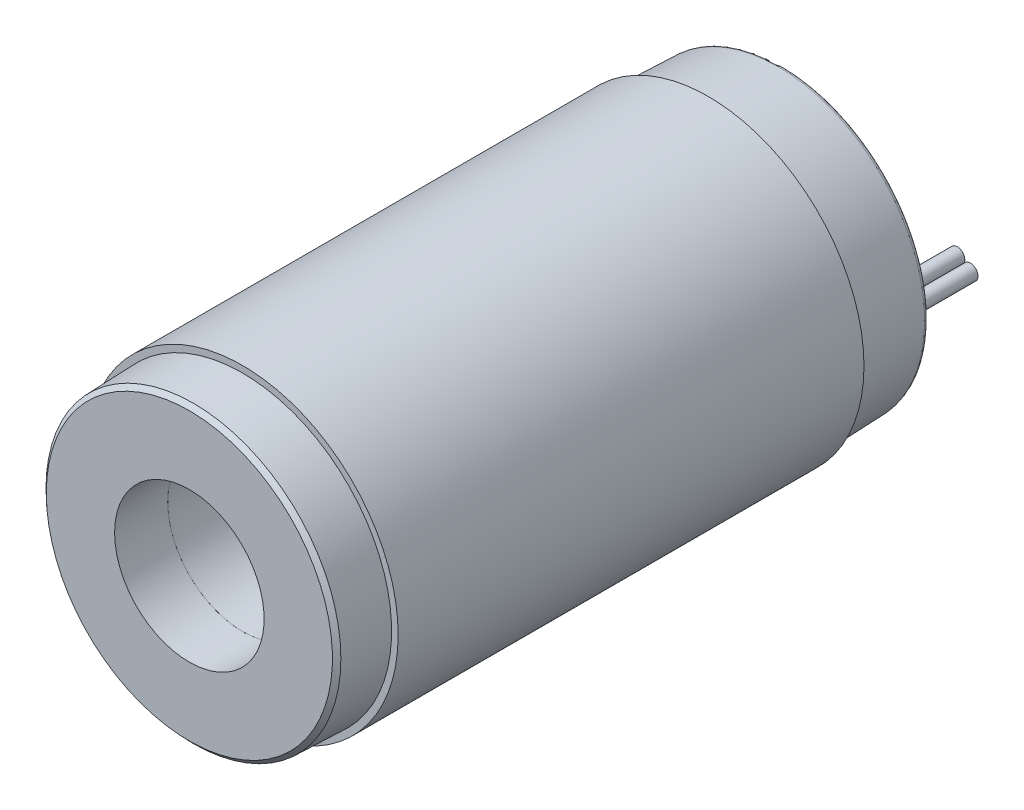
ISO-10303-21;
HEADER;
FILE_DESCRIPTION(('STEP AP214'),'2;1');
FILE_NAME('part.step','',(''),(''),'','','');
FILE_SCHEMA(('AUTOMOTIVE_DESIGN { 1 0 10303 214 1 1 1 1 }'));
ENDSEC;
DATA;
#1=APPLICATION_CONTEXT('core data for automotive mechanical design processes');
#2=APPLICATION_PROTOCOL_DEFINITION('international standard','automotive_design',2000,#1);
#3=PRODUCT_CONTEXT('',#1,'mechanical');
#4=PRODUCT('Part','Part','',(#3));
#5=PRODUCT_RELATED_PRODUCT_CATEGORY('part','',(#4));
#6=PRODUCT_DEFINITION_FORMATION('','',#4);
#7=PRODUCT_DEFINITION_CONTEXT('part definition',#1,'design');
#8=PRODUCT_DEFINITION('design','',#6,#7);
#9=PRODUCT_DEFINITION_SHAPE('','',#8);
#10=(LENGTH_UNIT() NAMED_UNIT(*) SI_UNIT(.MILLI.,.METRE.));
#11=(NAMED_UNIT(*) PLANE_ANGLE_UNIT() SI_UNIT($,.RADIAN.));
#12=(NAMED_UNIT(*) SI_UNIT($,.STERADIAN.) SOLID_ANGLE_UNIT());
#13=UNCERTAINTY_MEASURE_WITH_UNIT(LENGTH_MEASURE(1.E-05),#10,'distance_accuracy_value','');
#14=(GEOMETRIC_REPRESENTATION_CONTEXT(3) GLOBAL_UNCERTAINTY_ASSIGNED_CONTEXT((#13)) GLOBAL_UNIT_ASSIGNED_CONTEXT((#10,
#11,#12)) REPRESENTATION_CONTEXT('',''));
#15=CARTESIAN_POINT('',(0.,0.,0.));
#16=DIRECTION('',(0.,0.,1.));
#17=DIRECTION('',(1.,0.,0.));
#18=AXIS2_PLACEMENT_3D('',#15,#16,#17);
#19=CARTESIAN_POINT('',(0.,0.,-7.67378533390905));
#20=DIRECTION('',(0.,0.,-1.));
#21=DIRECTION('',(-1.,0.,0.));
#22=AXIS2_PLACEMENT_3D('',#19,#20,#21);
#23=CONICAL_SURFACE('',#22,11.1041974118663,0.174672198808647);
#24=CARTESIAN_POINT('',(0.,0.,-7.67378533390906));
#25=DIRECTION('',(0.,0.,-1.));
#26=DIRECTION('',(1.,0.,0.));
#27=AXIS2_PLACEMENT_3D('',#24,#25,#26);
#28=CIRCLE('',#27,11.1041974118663);
#29=CARTESIAN_POINT('',(11.1041974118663,0.,-7.67378533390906));
#30=VERTEX_POINT('',#29);
#31=EDGE_CURVE('P0_E98',#30,#30,#28,.F.);
#32=ORIENTED_EDGE('',*,*,#31,.T.);
#33=EDGE_LOOP('',(#32));
#34=FACE_BOUND('',#33,.T.);
#35=CARTESIAN_POINT('',(0.,0.,2.70287264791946E-10));
#36=DIRECTION('',(0.,0.,-1.));
#37=DIRECTION('',(-1.,0.,0.));
#38=AXIS2_PLACEMENT_3D('',#35,#36,#37);
#39=CIRCLE('',#38,9.75000000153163);
#40=CARTESIAN_POINT('',(-9.75000000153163,0.,2.70287264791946E-10));
#41=VERTEX_POINT('',#40);
#42=EDGE_CURVE('P0_E18',#41,#41,#39,.F.);
#43=ORIENTED_EDGE('',*,*,#42,.F.);
#44=EDGE_LOOP('',(#43));
#45=FACE_BOUND('',#44,.T.);
#46=ADVANCED_FACE('P0_F15',(#34,#45),#23,.T.);
#47=CARTESIAN_POINT('',(0.,0.,-7.5));
#48=DIRECTION('',(0.,0.,-1.));
#49=DIRECTION('',(1.,0.,0.));
#50=AXIS2_PLACEMENT_3D('',#47,#48,#49);
#51=TOROIDAL_SURFACE('',#50,12.0889809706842,0.999999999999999);
#52=CARTESIAN_POINT('',(0.,0.,-8.5));
#53=DIRECTION('',(0.,0.,1.));
#54=DIRECTION('',(-1.,0.,0.));
#55=AXIS2_PLACEMENT_3D('',#52,#53,#54);
#56=CIRCLE('',#55,12.0889809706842);
#57=CARTESIAN_POINT('',(-12.0889809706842,0.,-8.5));
#58=VERTEX_POINT('',#57);
#59=EDGE_CURVE('P0_E123',#58,#58,#56,.F.);
#60=ORIENTED_EDGE('',*,*,#59,.F.);
#61=EDGE_LOOP('',(#60));
#62=FACE_BOUND('',#61,.T.);
#63=ORIENTED_EDGE('',*,*,#31,.F.);
#64=EDGE_LOOP('',(#63));
#65=FACE_BOUND('',#64,.T.);
#66=ADVANCED_FACE('P0_F100',(#62,#65),#51,.F.);
#67=CARTESIAN_POINT('',(9.75,0.,0.));
#68=DIRECTION('',(0.,0.,1.));
#69=DIRECTION('',(1.,0.,0.));
#70=AXIS2_PLACEMENT_3D('',#67,#68,#69);
#71=PLANE('',#70);
#72=ORIENTED_EDGE('',*,*,#42,.T.);
#73=EDGE_LOOP('',(#72));
#74=FACE_BOUND('',#73,.T.);
#75=CARTESIAN_POINT('',(0.,0.,0.));
#76=DIRECTION('',(0.,0.,-1.));
#77=DIRECTION('',(-1.,0.,0.));
#78=AXIS2_PLACEMENT_3D('',#75,#76,#77);
#79=CIRCLE('',#78,9.15);
#80=CARTESIAN_POINT('',(-9.15,0.,0.));
#81=VERTEX_POINT('',#80);
#82=EDGE_CURVE('P0_E121',#81,#81,#79,.T.);
#83=ORIENTED_EDGE('',*,*,#82,.T.);
#84=EDGE_LOOP('',(#83));
#85=FACE_BOUND('',#84,.T.);
#86=ADVANCED_FACE('P0_F104',(#74,#85),#71,.T.);
#87=CARTESIAN_POINT('',(16.65,0.,-8.5));
#88=DIRECTION('',(0.,0.,1.));
#89=DIRECTION('',(1.,0.,0.));
#90=AXIS2_PLACEMENT_3D('',#87,#88,#89);
#91=PLANE('',#90);
#92=CARTESIAN_POINT('',(0.,0.,-8.5));
#93=DIRECTION('',(0.,0.,-1.));
#94=DIRECTION('',(-1.,0.,0.));
#95=AXIS2_PLACEMENT_3D('',#92,#93,#94);
#96=CIRCLE('',#95,16.65);
#97=CARTESIAN_POINT('',(-16.65,0.,-8.5));
#98=VERTEX_POINT('',#97);
#99=EDGE_CURVE('P0_E66',#98,#98,#96,.F.);
#100=ORIENTED_EDGE('',*,*,#99,.T.);
#101=EDGE_LOOP('',(#100));
#102=FACE_BOUND('',#101,.T.);
#103=ORIENTED_EDGE('',*,*,#59,.T.);
#104=EDGE_LOOP('',(#103));
#105=FACE_BOUND('',#104,.T.);
#106=ADVANCED_FACE('P0_F158',(#102,#105),#91,.T.);
#107=CARTESIAN_POINT('',(0.,0.,0.));
#108=DIRECTION('',(0.,0.,-1.));
#109=DIRECTION('',(-1.,0.,0.));
#110=AXIS2_PLACEMENT_3D('',#107,#108,#109);
#111=CYLINDRICAL_SURFACE('',#110,9.15);
#112=ORIENTED_EDGE('',*,*,#82,.F.);
#113=EDGE_LOOP('',(#112));
#114=FACE_BOUND('',#113,.T.);
#115=CARTESIAN_POINT('',(0.,0.,-8.));
#116=DIRECTION('',(0.,0.,-1.));
#117=DIRECTION('',(1.,0.,0.));
#118=AXIS2_PLACEMENT_3D('',#115,#116,#117);
#119=CIRCLE('',#118,9.15);
#120=CARTESIAN_POINT('',(9.15,0.,-8.));
#121=VERTEX_POINT('',#120);
#122=EDGE_CURVE('P0_E61',#121,#121,#119,.T.);
#123=ORIENTED_EDGE('',*,*,#122,.T.);
#124=EDGE_LOOP('',(#123));
#125=FACE_BOUND('',#124,.T.);
#126=ADVANCED_FACE('P0_F80',(#114,#125),#111,.F.);
#127=CARTESIAN_POINT('',(0.,0.,-7.5));
#128=DIRECTION('',(0.,0.,-1.));
#129=DIRECTION('',(1.,0.,0.));
#130=AXIS2_PLACEMENT_3D('',#127,#128,#129);
#131=TOROIDAL_SURFACE('',#130,16.65,1.);
#132=CARTESIAN_POINT('',(0.,0.,-7.5));
#133=DIRECTION('',(0.,0.,-1.));
#134=DIRECTION('',(-1.,0.,0.));
#135=AXIS2_PLACEMENT_3D('',#132,#133,#134);
#136=CIRCLE('',#135,17.65);
#137=CARTESIAN_POINT('',(-17.65,0.,-7.5));
#138=VERTEX_POINT('',#137);
#139=EDGE_CURVE('P0_E52',#138,#138,#136,.F.);
#140=ORIENTED_EDGE('',*,*,#139,.T.);
#141=EDGE_LOOP('',(#140));
#142=FACE_BOUND('',#141,.T.);
#143=ORIENTED_EDGE('',*,*,#99,.F.);
#144=EDGE_LOOP('',(#143));
#145=FACE_BOUND('',#144,.T.);
#146=ADVANCED_FACE('P0_F74',(#142,#145),#131,.F.);
#147=CARTESIAN_POINT('',(0.,0.,-9.00000000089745));
#148=DIRECTION('',(0.,0.,-1.));
#149=DIRECTION('',(-1.,0.,0.));
#150=AXIS2_PLACEMENT_3D('',#147,#148,#149);
#151=CONICAL_SURFACE('',#150,10.1499999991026,0.785398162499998);
#152=ORIENTED_EDGE('',*,*,#122,.F.);
#153=EDGE_LOOP('',(#152));
#154=FACE_BOUND('',#153,.T.);
#155=CARTESIAN_POINT('',(0.,0.,-9.00000000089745));
#156=DIRECTION('',(0.,0.,-1.));
#157=DIRECTION('',(-1.,0.,0.));
#158=AXIS2_PLACEMENT_3D('',#155,#156,#157);
#159=CIRCLE('',#158,10.1499999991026);
#160=CARTESIAN_POINT('',(-10.1499999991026,0.,-9.00000000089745));
#161=VERTEX_POINT('',#160);
#162=EDGE_CURVE('P0_E60',#161,#161,#159,.F.);
#163=ORIENTED_EDGE('',*,*,#162,.F.);
#164=EDGE_LOOP('',(#163));
#165=FACE_BOUND('',#164,.T.);
#166=ADVANCED_FACE('P0_F79',(#154,#165),#151,.F.);
#167=CARTESIAN_POINT('',(0.,0.,0.));
#168=DIRECTION('',(0.,0.,-1.));
#169=DIRECTION('',(-1.,0.,0.));
#170=AXIS2_PLACEMENT_3D('',#167,#168,#169);
#171=CYLINDRICAL_SURFACE('',#170,17.65);
#172=CARTESIAN_POINT('',(0.,0.,0.));
#173=DIRECTION('',(0.,0.,-1.));
#174=DIRECTION('',(-1.,0.,0.));
#175=AXIS2_PLACEMENT_3D('',#172,#173,#174);
#176=CIRCLE('',#175,17.65);
#177=CARTESIAN_POINT('',(-17.65,0.,0.));
#178=VERTEX_POINT('',#177);
#179=EDGE_CURVE('P0_E117',#178,#178,#176,.T.);
#180=ORIENTED_EDGE('',*,*,#179,.F.);
#181=EDGE_LOOP('',(#180));
#182=FACE_BOUND('',#181,.T.);
#183=ORIENTED_EDGE('',*,*,#139,.F.);
#184=EDGE_LOOP('',(#183));
#185=FACE_BOUND('',#184,.T.);
#186=ADVANCED_FACE('P0_F151',(#182,#185),#171,.F.);
#187=CARTESIAN_POINT('',(10.15,0.,-9.));
#188=DIRECTION('',(0.,0.,-1.));
#189=DIRECTION('',(-1.,0.,0.));
#190=AXIS2_PLACEMENT_3D('',#187,#188,#189);
#191=PLANE('',#190);
#192=ORIENTED_EDGE('',*,*,#162,.T.);
#193=EDGE_LOOP('',(#192));
#194=FACE_BOUND('',#193,.T.);
#195=CARTESIAN_POINT('',(0.,0.,-9.));
#196=DIRECTION('',(0.,0.,1.));
#197=DIRECTION('',(-1.,0.,0.));
#198=AXIS2_PLACEMENT_3D('',#195,#196,#197);
#199=CIRCLE('',#198,17.4528686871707);
#200=CARTESIAN_POINT('',(-17.4528686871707,0.,-9.));
#201=VERTEX_POINT('',#200);
#202=EDGE_CURVE('P0_E27',#201,#201,#199,.T.);
#203=ORIENTED_EDGE('',*,*,#202,.F.);
#204=EDGE_LOOP('',(#203));
#205=FACE_BOUND('',#204,.T.);
#206=ADVANCED_FACE('P0_F148',(#194,#205),#191,.T.);
#207=CARTESIAN_POINT('',(18.25,0.,0.));
#208=DIRECTION('',(0.,0.,1.));
#209=DIRECTION('',(1.,0.,0.));
#210=AXIS2_PLACEMENT_3D('',#207,#208,#209);
#211=PLANE('',#210);
#212=CARTESIAN_POINT('',(0.,0.,1.18290793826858E-11));
#213=DIRECTION('',(0.,0.,1.));
#214=DIRECTION('',(1.,0.,0.));
#215=AXIS2_PLACEMENT_3D('',#212,#213,#214);
#216=CIRCLE('',#215,18.2499999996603);
#217=CARTESIAN_POINT('',(18.2499999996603,0.,1.18290793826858E-11));
#218=VERTEX_POINT('',#217);
#219=EDGE_CURVE('P0_E22',#218,#218,#216,.F.);
#220=ORIENTED_EDGE('',*,*,#219,.F.);
#221=EDGE_LOOP('',(#220));
#222=FACE_BOUND('',#221,.T.);
#223=ORIENTED_EDGE('',*,*,#179,.T.);
#224=EDGE_LOOP('',(#223));
#225=FACE_BOUND('',#224,.T.);
#226=ADVANCED_FACE('P0_F43',(#222,#225),#211,.T.);
#227=CARTESIAN_POINT('',(0.,0.,-8.5));
#228=DIRECTION('',(0.,0.,-1.));
#229=DIRECTION('',(1.,0.,0.));
#230=AXIS2_PLACEMENT_3D('',#227,#228,#229);
#231=TOROIDAL_SURFACE('',#230,17.4528686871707,0.499999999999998);
#232=ORIENTED_EDGE('',*,*,#202,.T.);
#233=EDGE_LOOP('',(#232));
#234=FACE_BOUND('',#233,.T.);
#235=CARTESIAN_POINT('',(0.,0.,-8.51744974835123));
#236=DIRECTION('',(0.,0.,1.));
#237=DIRECTION('',(-1.,0.,0.));
#238=AXIS2_PLACEMENT_3D('',#235,#236,#237);
#239=CIRCLE('',#238,17.9525641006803);
#240=CARTESIAN_POINT('',(-17.9525641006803,0.,-8.51744974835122));
#241=VERTEX_POINT('',#240);
#242=EDGE_CURVE('P0_E10',#241,#241,#239,.T.);
#243=ORIENTED_EDGE('',*,*,#242,.F.);
#244=EDGE_LOOP('',(#243));
#245=FACE_BOUND('',#244,.T.);
#246=ADVANCED_FACE('P0_F37',(#234,#245),#231,.T.);
#247=CARTESIAN_POINT('',(0.,0.,1.18238752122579E-11));
#248=DIRECTION('',(0.,0.,1.));
#249=DIRECTION('',(1.,0.,0.));
#250=AXIS2_PLACEMENT_3D('',#247,#248,#249);
#251=CONICAL_SURFACE('',#250,18.2499999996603,0.0349065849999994);
#252=ORIENTED_EDGE('',*,*,#242,.T.);
#253=EDGE_LOOP('',(#252));
#254=FACE_BOUND('',#253,.T.);
#255=ORIENTED_EDGE('',*,*,#219,.T.);
#256=EDGE_LOOP('',(#255));
#257=FACE_BOUND('',#256,.T.);
#258=ADVANCED_FACE('P0_F42',(#254,#257),#251,.T.);
#259=CLOSED_SHELL('',(#46,#66,#86,#106,#126,#146,#166,#186,#206,#226,#246,#258));
#260=MANIFOLD_SOLID_BREP('P0_B1',#259);
#261=CARTESIAN_POINT('',(0.,0.,61.7));
#262=DIRECTION('',(0.,0.,-1.));
#263=DIRECTION('',(1.,0.,0.));
#264=AXIS2_PLACEMENT_3D('',#261,#262,#263);
#265=TOROIDAL_SURFACE('',#264,16.65,1.);
#266=CARTESIAN_POINT('',(0.,0.,61.7));
#267=DIRECTION('',(0.,0.,-1.));
#268=DIRECTION('',(-1.,0.,0.));
#269=AXIS2_PLACEMENT_3D('',#266,#267,#268);
#270=CIRCLE('',#269,17.65);
#271=CARTESIAN_POINT('',(-17.65,0.,61.7));
#272=VERTEX_POINT('',#271);
#273=EDGE_CURVE('P1_E67',#272,#272,#270,.T.);
#274=ORIENTED_EDGE('',*,*,#273,.T.);
#275=EDGE_LOOP('',(#274));
#276=FACE_BOUND('',#275,.T.);
#277=CARTESIAN_POINT('',(0.,0.,62.7));
#278=DIRECTION('',(0.,0.,1.));
#279=DIRECTION('',(-1.,0.,0.));
#280=AXIS2_PLACEMENT_3D('',#277,#278,#279);
#281=CIRCLE('',#280,16.65);
#282=CARTESIAN_POINT('',(-16.65,0.,62.7));
#283=VERTEX_POINT('',#282);
#284=EDGE_CURVE('P1_E94',#283,#283,#281,.T.);
#285=ORIENTED_EDGE('',*,*,#284,.T.);
#286=EDGE_LOOP('',(#285));
#287=FACE_BOUND('',#286,.T.);
#288=ADVANCED_FACE('P1_F15',(#276,#287),#265,.F.);
#289=CARTESIAN_POINT('',(16.65,0.,62.7));
#290=DIRECTION('',(0.,0.,1.));
#291=DIRECTION('',(1.,0.,0.));
#292=AXIS2_PLACEMENT_3D('',#289,#290,#291);
#293=PLANE('',#292);
#294=ORIENTED_EDGE('',*,*,#284,.F.);
#295=EDGE_LOOP('',(#294));
#296=FACE_BOUND('',#295,.T.);
#297=CARTESIAN_POINT('',(0.,0.,62.7));
#298=DIRECTION('',(0.,0.,-1.));
#299=DIRECTION('',(-1.,0.,0.));
#300=AXIS2_PLACEMENT_3D('',#297,#298,#299);
#301=CIRCLE('',#300,12.);
#302=CARTESIAN_POINT('',(-12.,0.,62.7));
#303=VERTEX_POINT('',#302);
#304=EDGE_CURVE('P1_E58',#303,#303,#301,.F.);
#305=ORIENTED_EDGE('',*,*,#304,.T.);
#306=EDGE_LOOP('',(#305));
#307=FACE_BOUND('',#306,.T.);
#308=ADVANCED_FACE('P1_F107',(#296,#307),#293,.F.);
#309=CARTESIAN_POINT('',(0.,0.,0.));
#310=DIRECTION('',(0.,0.,-1.));
#311=DIRECTION('',(-1.,0.,0.));
#312=AXIS2_PLACEMENT_3D('',#309,#310,#311);
#313=CYLINDRICAL_SURFACE('',#312,17.65);
#314=CARTESIAN_POINT('',(0.,0.,57.));
#315=DIRECTION('',(0.,0.,-1.));
#316=DIRECTION('',(-1.,0.,0.));
#317=AXIS2_PLACEMENT_3D('',#314,#315,#316);
#318=CIRCLE('',#317,17.65);
#319=CARTESIAN_POINT('',(-17.65,0.,57.));
#320=VERTEX_POINT('',#319);
#321=EDGE_CURVE('P1_E20',#320,#320,#318,.T.);
#322=ORIENTED_EDGE('',*,*,#321,.T.);
#323=EDGE_LOOP('',(#322));
#324=FACE_BOUND('',#323,.T.);
#325=ORIENTED_EDGE('',*,*,#273,.F.);
#326=EDGE_LOOP('',(#325));
#327=FACE_BOUND('',#326,.T.);
#328=ADVANCED_FACE('P1_F76',(#324,#327),#313,.F.);
#329=CARTESIAN_POINT('',(0.,0.,61.7));
#330=DIRECTION('',(0.,0.,-1.));
#331=DIRECTION('',(1.,0.,0.));
#332=AXIS2_PLACEMENT_3D('',#329,#330,#331);
#333=TOROIDAL_SURFACE('',#332,12.,1.);
#334=ORIENTED_EDGE('',*,*,#304,.F.);
#335=EDGE_LOOP('',(#334));
#336=FACE_BOUND('',#335,.T.);
#337=CARTESIAN_POINT('',(0.,0.,61.7));
#338=DIRECTION('',(0.,0.,-1.));
#339=DIRECTION('',(-1.,0.,0.));
#340=AXIS2_PLACEMENT_3D('',#337,#338,#339);
#341=CIRCLE('',#340,11.);
#342=CARTESIAN_POINT('',(-11.,0.,61.7));
#343=VERTEX_POINT('',#342);
#344=EDGE_CURVE('P1_E47',#343,#343,#341,.T.);
#345=ORIENTED_EDGE('',*,*,#344,.F.);
#346=EDGE_LOOP('',(#345));
#347=FACE_BOUND('',#346,.T.);
#348=ADVANCED_FACE('P1_F70',(#336,#347),#333,.F.);
#349=CARTESIAN_POINT('',(18.25,0.,57.));
#350=DIRECTION('',(0.,0.,1.));
#351=DIRECTION('',(1.,0.,0.));
#352=AXIS2_PLACEMENT_3D('',#349,#350,#351);
#353=PLANE('',#352);
#354=CARTESIAN_POINT('',(0.,0.,56.999999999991));
#355=DIRECTION('',(0.,0.,-1.));
#356=DIRECTION('',(-1.,0.,0.));
#357=AXIS2_PLACEMENT_3D('',#354,#355,#356);
#358=CIRCLE('',#357,18.2499999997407);
#359=CARTESIAN_POINT('',(-18.2499999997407,0.,56.999999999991));
#360=VERTEX_POINT('',#359);
#361=EDGE_CURVE('P1_E44',#360,#360,#358,.F.);
#362=ORIENTED_EDGE('',*,*,#361,.F.);
#363=EDGE_LOOP('',(#362));
#364=FACE_BOUND('',#363,.T.);
#365=ORIENTED_EDGE('',*,*,#321,.F.);
#366=EDGE_LOOP('',(#365));
#367=FACE_BOUND('',#366,.T.);
#368=ADVANCED_FACE('P1_F75',(#364,#367),#353,.F.);
#369=CARTESIAN_POINT('',(0.,0.,0.));
#370=DIRECTION('',(0.,0.,-1.));
#371=DIRECTION('',(-1.,0.,0.));
#372=AXIS2_PLACEMENT_3D('',#369,#370,#371);
#373=CYLINDRICAL_SURFACE('',#372,11.);
#374=ORIENTED_EDGE('',*,*,#344,.T.);
#375=EDGE_LOOP('',(#374));
#376=FACE_BOUND('',#375,.T.);
#377=CARTESIAN_POINT('',(0.,0.,57.));
#378=DIRECTION('',(0.,0.,-1.));
#379=DIRECTION('',(-1.,0.,0.));
#380=AXIS2_PLACEMENT_3D('',#377,#378,#379);
#381=CIRCLE('',#380,11.);
#382=CARTESIAN_POINT('',(-11.,0.,57.));
#383=VERTEX_POINT('',#382);
#384=EDGE_CURVE('P1_E41',#383,#383,#381,.F.);
#385=ORIENTED_EDGE('',*,*,#384,.T.);
#386=EDGE_LOOP('',(#385));
#387=FACE_BOUND('',#386,.T.);
#388=ADVANCED_FACE('P1_F157',(#376,#387),#373,.T.);
#389=CARTESIAN_POINT('',(0.,0.,56.999999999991));
#390=DIRECTION('',(0.,0.,-1.));
#391=DIRECTION('',(-1.,0.,0.));
#392=AXIS2_PLACEMENT_3D('',#389,#390,#391);
#393=CONICAL_SURFACE('',#392,18.2499999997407,0.0349065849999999);
#394=ORIENTED_EDGE('',*,*,#361,.T.);
#395=EDGE_LOOP('',(#394));
#396=FACE_BOUND('',#395,.T.);
#397=CARTESIAN_POINT('',(0.,0.,63.0003045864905));
#398=DIRECTION('',(0.,0.,-1.));
#399=DIRECTION('',(1.,0.,0.));
#400=AXIS2_PLACEMENT_3D('',#397,#398,#399);
#401=CIRCLE('',#400,18.0404647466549);
#402=CARTESIAN_POINT('',(18.0404647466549,0.,63.0003045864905));
#403=VERTEX_POINT('',#402);
#404=EDGE_CURVE('P1_E40',#403,#403,#401,.F.);
#405=ORIENTED_EDGE('',*,*,#404,.F.);
#406=EDGE_LOOP('',(#405));
#407=FACE_BOUND('',#406,.T.);
#408=ADVANCED_FACE('P1_F154',(#396,#407),#393,.T.);
#409=CARTESIAN_POINT('',(11.,0.,57.));
#410=DIRECTION('',(0.,0.,1.));
#411=DIRECTION('',(1.,0.,0.));
#412=AXIS2_PLACEMENT_3D('',#409,#410,#411);
#413=PLANE('',#412);
#414=ORIENTED_EDGE('',*,*,#384,.F.);
#415=EDGE_LOOP('',(#414));
#416=FACE_BOUND('',#415,.T.);
#417=CARTESIAN_POINT('',(0.,0.,57.));
#418=DIRECTION('',(0.,0.,-1.));
#419=DIRECTION('',(-1.,0.,0.));
#420=AXIS2_PLACEMENT_3D('',#417,#418,#419);
#421=CIRCLE('',#420,9.14999999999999);
#422=CARTESIAN_POINT('',(-9.14999999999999,0.,57.));
#423=VERTEX_POINT('',#422);
#424=EDGE_CURVE('P1_E30',#423,#423,#421,.F.);
#425=ORIENTED_EDGE('',*,*,#424,.T.);
#426=EDGE_LOOP('',(#425));
#427=FACE_BOUND('',#426,.T.);
#428=ADVANCED_FACE('P1_F150',(#416,#427),#413,.F.);
#429=CARTESIAN_POINT('',(0.,0.,63.0003045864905));
#430=DIRECTION('',(0.,0.,-1.));
#431=DIRECTION('',(-1.,0.,0.));
#432=AXIS2_PLACEMENT_3D('',#429,#430,#431);
#433=CONICAL_SURFACE('',#432,18.0404647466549,0.820304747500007);
#434=ORIENTED_EDGE('',*,*,#404,.T.);
#435=EDGE_LOOP('',(#434));
#436=FACE_BOUND('',#435,.T.);
#437=CARTESIAN_POINT('',(0.,0.,63.5000000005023));
#438=DIRECTION('',(0.,0.,-1.));
#439=DIRECTION('',(-1.,0.,0.));
#440=AXIS2_PLACEMENT_3D('',#437,#438,#439);
#441=CIRCLE('',#440,17.5046070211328);
#442=CARTESIAN_POINT('',(-17.5046070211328,0.,63.5000000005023));
#443=VERTEX_POINT('',#442);
#444=EDGE_CURVE('P1_E24',#443,#443,#441,.T.);
#445=ORIENTED_EDGE('',*,*,#444,.T.);
#446=EDGE_LOOP('',(#445));
#447=FACE_BOUND('',#446,.T.);
#448=ADVANCED_FACE('P1_F143',(#436,#447),#433,.T.);
#449=CARTESIAN_POINT('',(0.,0.,0.));
#450=DIRECTION('',(0.,0.,-1.));
#451=DIRECTION('',(-1.,0.,0.));
#452=AXIS2_PLACEMENT_3D('',#449,#450,#451);
#453=CYLINDRICAL_SURFACE('',#452,9.14999999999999);
#454=ORIENTED_EDGE('',*,*,#424,.F.);
#455=EDGE_LOOP('',(#454));
#456=FACE_BOUND('',#455,.T.);
#457=CARTESIAN_POINT('',(0.,0.,63.5));
#458=DIRECTION('',(0.,0.,-1.));
#459=DIRECTION('',(-1.,0.,0.));
#460=AXIS2_PLACEMENT_3D('',#457,#458,#459);
#461=CIRCLE('',#460,9.14999999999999);
#462=CARTESIAN_POINT('',(-9.14999999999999,0.,63.5));
#463=VERTEX_POINT('',#462);
#464=EDGE_CURVE('P1_E10',#463,#463,#461,.F.);
#465=ORIENTED_EDGE('',*,*,#464,.T.);
#466=EDGE_LOOP('',(#465));
#467=FACE_BOUND('',#466,.T.);
#468=ADVANCED_FACE('P1_F136',(#456,#467),#453,.F.);
#469=CARTESIAN_POINT('',(9.14999999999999,0.,63.5));
#470=DIRECTION('',(0.,0.,-1.));
#471=DIRECTION('',(-1.,0.,0.));
#472=AXIS2_PLACEMENT_3D('',#469,#470,#471);
#473=PLANE('',#472);
#474=ORIENTED_EDGE('',*,*,#464,.F.);
#475=EDGE_LOOP('',(#474));
#476=FACE_BOUND('',#475,.T.);
#477=ORIENTED_EDGE('',*,*,#444,.F.);
#478=EDGE_LOOP('',(#477));
#479=FACE_BOUND('',#478,.T.);
#480=ADVANCED_FACE('P1_F134',(#476,#479),#473,.F.);
#481=CLOSED_SHELL('',(#288,#308,#328,#348,#368,#388,#408,#428,#448,#468,#480));
#482=MANIFOLD_SOLID_BREP('P1_B1',#481);
#483=CARTESIAN_POINT('',(0.,0.,0.));
#484=DIRECTION('',(0.,0.,1.));
#485=DIRECTION('',(1.,0.,0.));
#486=AXIS2_PLACEMENT_3D('',#483,#484,#485);
#487=CYLINDRICAL_SURFACE('',#486,9.15);
#488=CARTESIAN_POINT('',(0.,0.,0.));
#489=DIRECTION('',(0.,0.,1.));
#490=DIRECTION('',(1.,0.,0.));
#491=AXIS2_PLACEMENT_3D('',#488,#489,#490);
#492=CIRCLE('',#491,9.15);
#493=CARTESIAN_POINT('',(9.15,0.,0.));
#494=VERTEX_POINT('',#493);
#495=EDGE_CURVE('P2_E28',#494,#494,#492,.T.);
#496=ORIENTED_EDGE('',*,*,#495,.F.);
#497=EDGE_LOOP('',(#496));
#498=FACE_BOUND('',#497,.T.);
#499=CARTESIAN_POINT('',(0.,0.,57.));
#500=DIRECTION('',(0.,0.,1.));
#501=DIRECTION('',(1.,0.,0.));
#502=AXIS2_PLACEMENT_3D('',#499,#500,#501);
#503=CIRCLE('',#502,9.15);
#504=CARTESIAN_POINT('',(9.15,0.,57.));
#505=VERTEX_POINT('',#504);
#506=EDGE_CURVE('P2_E18',#505,#505,#503,.F.);
#507=ORIENTED_EDGE('',*,*,#506,.F.);
#508=EDGE_LOOP('',(#507));
#509=FACE_BOUND('',#508,.T.);
#510=ADVANCED_FACE('P2_F15',(#498,#509),#487,.F.);
#511=CARTESIAN_POINT('',(0.,0.,57.));
#512=DIRECTION('',(0.,0.,1.));
#513=DIRECTION('',(1.,0.,0.));
#514=AXIS2_PLACEMENT_3D('',#511,#512,#513);
#515=PLANE('',#514);
#516=CARTESIAN_POINT('',(0.,0.,57.));
#517=DIRECTION('',(0.,0.,1.));
#518=DIRECTION('',(1.,0.,0.));
#519=AXIS2_PLACEMENT_3D('',#516,#517,#518);
#520=CIRCLE('',#519,19.05);
#521=CARTESIAN_POINT('',(19.05,0.,57.));
#522=VERTEX_POINT('',#521);
#523=EDGE_CURVE('P2_E22',#522,#522,#520,.F.);
#524=ORIENTED_EDGE('',*,*,#523,.F.);
#525=EDGE_LOOP('',(#524));
#526=FACE_BOUND('',#525,.T.);
#527=ORIENTED_EDGE('',*,*,#506,.T.);
#528=EDGE_LOOP('',(#527));
#529=FACE_BOUND('',#528,.T.);
#530=ADVANCED_FACE('P2_F38',(#526,#529),#515,.T.);
#531=CARTESIAN_POINT('',(0.,0.,0.));
#532=DIRECTION('',(0.,0.,-1.));
#533=DIRECTION('',(-1.,0.,0.));
#534=AXIS2_PLACEMENT_3D('',#531,#532,#533);
#535=PLANE('',#534);
#536=CARTESIAN_POINT('',(0.,0.,0.));
#537=DIRECTION('',(0.,0.,1.));
#538=DIRECTION('',(1.,0.,0.));
#539=AXIS2_PLACEMENT_3D('',#536,#537,#538);
#540=CIRCLE('',#539,19.05);
#541=CARTESIAN_POINT('',(19.05,0.,0.));
#542=VERTEX_POINT('',#541);
#543=EDGE_CURVE('P2_E10',#542,#542,#540,.T.);
#544=ORIENTED_EDGE('',*,*,#543,.F.);
#545=EDGE_LOOP('',(#544));
#546=FACE_BOUND('',#545,.T.);
#547=ORIENTED_EDGE('',*,*,#495,.T.);
#548=EDGE_LOOP('',(#547));
#549=FACE_BOUND('',#548,.T.);
#550=ADVANCED_FACE('P2_F46',(#546,#549),#535,.T.);
#551=CARTESIAN_POINT('',(0.,0.,0.));
#552=DIRECTION('',(0.,0.,1.));
#553=DIRECTION('',(1.,0.,0.));
#554=AXIS2_PLACEMENT_3D('',#551,#552,#553);
#555=CYLINDRICAL_SURFACE('',#554,19.05);
#556=ORIENTED_EDGE('',*,*,#543,.T.);
#557=EDGE_LOOP('',(#556));
#558=FACE_BOUND('',#557,.T.);
#559=ORIENTED_EDGE('',*,*,#523,.T.);
#560=EDGE_LOOP('',(#559));
#561=FACE_BOUND('',#560,.T.);
#562=ADVANCED_FACE('P2_F48',(#558,#561),#555,.T.);
#563=CLOSED_SHELL('',(#510,#530,#550,#562));
#564=MANIFOLD_SOLID_BREP('P2_B1',#563);
#565=CARTESIAN_POINT('',(13.9641016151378,0.,-8.5));
#566=DIRECTION('',(0.,0.,-1.));
#567=DIRECTION('',(-1.,0.,0.));
#568=AXIS2_PLACEMENT_3D('',#565,#566,#567);
#569=PLANE('',#568);
#570=CARTESIAN_POINT('',(15.5717967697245,0.,-8.5));
#571=DIRECTION('',(0.,0.,1.));
#572=DIRECTION('',(1.,0.,0.));
#573=AXIS2_PLACEMENT_3D('',#570,#571,#572);
#574=CIRCLE('',#573,0.928203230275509);
#575=CARTESIAN_POINT('',(14.7679491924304,0.46410161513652,-8.5));
#576=VERTEX_POINT('',#575);
#577=CARTESIAN_POINT('',(14.7679491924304,-0.464101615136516,-8.5));
#578=VERTEX_POINT('',#577);
#579=EDGE_CURVE('P3_E50',#576,#578,#574,.F.);
#580=ORIENTED_EDGE('',*,*,#579,.F.);
#581=CARTESIAN_POINT('',(13.9641016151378,0.928203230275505,-8.5));
#582=DIRECTION('',(0.,0.,1.));
#583=DIRECTION('',(1.,0.,0.));
#584=AXIS2_PLACEMENT_3D('',#581,#582,#583);
#585=CIRCLE('',#584,0.928203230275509);
#586=CARTESIAN_POINT('',(13.9641016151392,0.,-8.5));
#587=VERTEX_POINT('',#586);
#588=EDGE_CURVE('P3_E52',#587,#576,#585,.F.);
#589=ORIENTED_EDGE('',*,*,#588,.F.);
#590=CARTESIAN_POINT('',(13.9641016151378,-0.928203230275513,-8.5));
#591=DIRECTION('',(0.,0.,1.));
#592=DIRECTION('',(1.,0.,0.));
#593=AXIS2_PLACEMENT_3D('',#590,#591,#592);
#594=CIRCLE('',#593,0.928203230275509);
#595=EDGE_CURVE('P3_E19',#578,#587,#594,.F.);
#596=ORIENTED_EDGE('',*,*,#595,.F.);
#597=EDGE_LOOP('',(#580,#589,#596));
#598=FACE_BOUND('',#597,.T.);
#599=ADVANCED_FACE('P3_F16',(#598),#569,.F.);
#600=CARTESIAN_POINT('',(13.9641016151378,-0.928203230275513,-16.5));
#601=DIRECTION('',(0.,0.,1.));
#602=DIRECTION('',(1.,0.,0.));
#603=AXIS2_PLACEMENT_3D('',#600,#601,#602);
#604=CYLINDRICAL_SURFACE('',#603,0.928203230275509);
#605=CARTESIAN_POINT('',(13.9641016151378,-0.928203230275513,-16.5));
#606=DIRECTION('',(0.,0.,1.));
#607=DIRECTION('',(1.,0.,0.));
#608=AXIS2_PLACEMENT_3D('',#605,#606,#607);
#609=CIRCLE('',#608,0.928203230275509);
#610=CARTESIAN_POINT('',(14.7679491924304,-0.464101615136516,-16.5));
#611=VERTEX_POINT('',#610);
#612=CARTESIAN_POINT('',(13.9641016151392,0.,-16.5));
#613=VERTEX_POINT('',#612);
#614=EDGE_CURVE('P3_E56',#611,#613,#609,.F.);
#615=ORIENTED_EDGE('',*,*,#614,.F.);
#616=DIRECTION('',(0.,0.,1.));
#617=VECTOR('',#616,1.);
#618=CARTESIAN_POINT('',(14.7679491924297,-0.464101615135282,-16.5));
#619=LINE('',#618,#617);
#620=EDGE_CURVE('P3_E58',#578,#611,#619,.F.);
#621=ORIENTED_EDGE('',*,*,#620,.F.);
#622=ORIENTED_EDGE('',*,*,#595,.T.);
#623=DIRECTION('',(0.,0.,1.));
#624=VECTOR('',#623,1.);
#625=CARTESIAN_POINT('',(13.9641016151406,0.,-16.5));
#626=LINE('',#625,#624);
#627=EDGE_CURVE('P3_E64',#613,#587,#626,.T.);
#628=ORIENTED_EDGE('',*,*,#627,.F.);
#629=EDGE_LOOP('',(#615,#621,#622,#628));
#630=FACE_BOUND('',#629,.T.);
#631=ADVANCED_FACE('P3_F59',(#630),#604,.T.);
#632=CARTESIAN_POINT('',(13.9641016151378,0.,-16.5));
#633=DIRECTION('',(0.,0.,-1.));
#634=DIRECTION('',(-1.,0.,0.));
#635=AXIS2_PLACEMENT_3D('',#632,#633,#634);
#636=PLANE('',#635);
#637=CARTESIAN_POINT('',(13.9641016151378,0.928203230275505,-16.5));
#638=DIRECTION('',(0.,0.,1.));
#639=DIRECTION('',(1.,0.,0.));
#640=AXIS2_PLACEMENT_3D('',#637,#638,#639);
#641=CIRCLE('',#640,0.928203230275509);
#642=CARTESIAN_POINT('',(14.7679491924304,0.464101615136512,-16.5));
#643=VERTEX_POINT('',#642);
#644=EDGE_CURVE('P3_E34',#643,#613,#641,.T.);
#645=ORIENTED_EDGE('',*,*,#644,.F.);
#646=CARTESIAN_POINT('',(15.5717967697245,0.,-16.5));
#647=DIRECTION('',(0.,0.,1.));
#648=DIRECTION('',(1.,0.,0.));
#649=AXIS2_PLACEMENT_3D('',#646,#647,#648);
#650=CIRCLE('',#649,0.928203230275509);
#651=EDGE_CURVE('P3_E25',#611,#643,#650,.T.);
#652=ORIENTED_EDGE('',*,*,#651,.F.);
#653=ORIENTED_EDGE('',*,*,#614,.T.);
#654=EDGE_LOOP('',(#645,#652,#653));
#655=FACE_BOUND('',#654,.T.);
#656=ADVANCED_FACE('P3_F70',(#655),#636,.T.);
#657=CARTESIAN_POINT('',(13.9641016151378,0.928203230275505,-16.5));
#658=DIRECTION('',(0.,0.,1.));
#659=DIRECTION('',(1.,0.,0.));
#660=AXIS2_PLACEMENT_3D('',#657,#658,#659);
#661=CYLINDRICAL_SURFACE('',#660,0.928203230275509);
#662=ORIENTED_EDGE('',*,*,#644,.T.);
#663=ORIENTED_EDGE('',*,*,#627,.T.);
#664=ORIENTED_EDGE('',*,*,#588,.T.);
#665=DIRECTION('',(0.,0.,1.));
#666=VECTOR('',#665,1.);
#667=CARTESIAN_POINT('',(14.7679491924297,0.464101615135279,-16.5));
#668=LINE('',#667,#666);
#669=EDGE_CURVE('P3_E11',#643,#576,#668,.T.);
#670=ORIENTED_EDGE('',*,*,#669,.F.);
#671=EDGE_LOOP('',(#662,#663,#664,#670));
#672=FACE_BOUND('',#671,.T.);
#673=ADVANCED_FACE('P3_F72',(#672),#661,.T.);
#674=CARTESIAN_POINT('',(15.5717967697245,0.,-16.5));
#675=DIRECTION('',(0.,0.,1.));
#676=DIRECTION('',(1.,0.,0.));
#677=AXIS2_PLACEMENT_3D('',#674,#675,#676);
#678=CYLINDRICAL_SURFACE('',#677,0.928203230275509);
#679=ORIENTED_EDGE('',*,*,#651,.T.);
#680=ORIENTED_EDGE('',*,*,#669,.T.);
#681=ORIENTED_EDGE('',*,*,#579,.T.);
#682=ORIENTED_EDGE('',*,*,#620,.T.);
#683=EDGE_LOOP('',(#679,#680,#681,#682));
#684=FACE_BOUND('',#683,.T.);
#685=ADVANCED_FACE('P3_F63',(#684),#678,.T.);
#686=CLOSED_SHELL('',(#599,#631,#656,#673,#685));
#687=MANIFOLD_SOLID_BREP('P3_B1',#686);
#688=CARTESIAN_POINT('',(0.,0.,62.7));
#689=DIRECTION('',(0.,0.,1.));
#690=DIRECTION('',(1.,0.,0.));
#691=AXIS2_PLACEMENT_3D('',#688,#689,#690);
#692=PLANE('',#691);
#693=CARTESIAN_POINT('',(0.,0.,62.7));
#694=DIRECTION('',(0.,0.,-1.));
#695=DIRECTION('',(1.,0.,0.));
#696=AXIS2_PLACEMENT_3D('',#693,#694,#695);
#697=CIRCLE('',#696,16.65);
#698=CARTESIAN_POINT('',(16.65,0.,62.7));
#699=VERTEX_POINT('',#698);
#700=EDGE_CURVE('P4_E72',#699,#699,#697,.T.);
#701=ORIENTED_EDGE('',*,*,#700,.F.);
#702=EDGE_LOOP('',(#701));
#703=FACE_BOUND('',#702,.T.);
#704=CARTESIAN_POINT('',(0.,0.,62.7));
#705=DIRECTION('',(0.,0.,1.));
#706=DIRECTION('',(1.,0.,0.));
#707=AXIS2_PLACEMENT_3D('',#704,#705,#706);
#708=CIRCLE('',#707,12.);
#709=CARTESIAN_POINT('',(12.,0.,62.7));
#710=VERTEX_POINT('',#709);
#711=EDGE_CURVE('P4_E60',#710,#710,#708,.T.);
#712=ORIENTED_EDGE('',*,*,#711,.F.);
#713=EDGE_LOOP('',(#712));
#714=FACE_BOUND('',#713,.T.);
#715=ADVANCED_FACE('P4_F15',(#703,#714),#692,.T.);
#716=CARTESIAN_POINT('',(0.,0.,61.7));
#717=DIRECTION('',(0.,0.,1.));
#718=DIRECTION('',(-1.,0.,0.));
#719=AXIS2_PLACEMENT_3D('',#716,#717,#718);
#720=TOROIDAL_SURFACE('',#719,16.65,1.);
#721=ORIENTED_EDGE('',*,*,#700,.T.);
#722=EDGE_LOOP('',(#721));
#723=FACE_BOUND('',#722,.T.);
#724=CARTESIAN_POINT('',(0.,0.,61.7));
#725=DIRECTION('',(0.,0.,-1.));
#726=DIRECTION('',(-1.,0.,0.));
#727=AXIS2_PLACEMENT_3D('',#724,#725,#726);
#728=CIRCLE('',#727,17.65);
#729=CARTESIAN_POINT('',(-17.65,0.,61.7));
#730=VERTEX_POINT('',#729);
#731=EDGE_CURVE('P4_E90',#730,#730,#728,.T.);
#732=ORIENTED_EDGE('',*,*,#731,.F.);
#733=EDGE_LOOP('',(#732));
#734=FACE_BOUND('',#733,.T.);
#735=ADVANCED_FACE('P4_F37',(#723,#734),#720,.T.);
#736=CARTESIAN_POINT('',(0.,0.,61.7));
#737=DIRECTION('',(0.,0.,1.));
#738=DIRECTION('',(-1.,0.,0.));
#739=AXIS2_PLACEMENT_3D('',#736,#737,#738);
#740=TOROIDAL_SURFACE('',#739,12.,1.);
#741=CARTESIAN_POINT('',(0.,0.,61.7));
#742=DIRECTION('',(0.,0.,-1.));
#743=DIRECTION('',(-1.,0.,0.));
#744=AXIS2_PLACEMENT_3D('',#741,#742,#743);
#745=CIRCLE('',#744,11.);
#746=CARTESIAN_POINT('',(-11.,0.,61.7));
#747=VERTEX_POINT('',#746);
#748=EDGE_CURVE('P4_E30',#747,#747,#745,.T.);
#749=ORIENTED_EDGE('',*,*,#748,.T.);
#750=EDGE_LOOP('',(#749));
#751=FACE_BOUND('',#750,.T.);
#752=ORIENTED_EDGE('',*,*,#711,.T.);
#753=EDGE_LOOP('',(#752));
#754=FACE_BOUND('',#753,.T.);
#755=ADVANCED_FACE('P4_F47',(#751,#754),#740,.T.);
#756=CARTESIAN_POINT('',(0.,0.,62.7));
#757=DIRECTION('',(0.,0.,-1.));
#758=DIRECTION('',(-1.,0.,0.));
#759=AXIS2_PLACEMENT_3D('',#756,#757,#758);
#760=CYLINDRICAL_SURFACE('',#759,17.65);
#761=CARTESIAN_POINT('',(0.,0.,57.));
#762=DIRECTION('',(0.,0.,-1.));
#763=DIRECTION('',(-1.,0.,0.));
#764=AXIS2_PLACEMENT_3D('',#761,#762,#763);
#765=CIRCLE('',#764,17.65);
#766=CARTESIAN_POINT('',(-17.65,0.,57.));
#767=VERTEX_POINT('',#766);
#768=EDGE_CURVE('P4_E19',#767,#767,#765,.F.);
#769=ORIENTED_EDGE('',*,*,#768,.T.);
#770=EDGE_LOOP('',(#769));
#771=FACE_BOUND('',#770,.T.);
#772=ORIENTED_EDGE('',*,*,#731,.T.);
#773=EDGE_LOOP('',(#772));
#774=FACE_BOUND('',#773,.T.);
#775=ADVANCED_FACE('P4_F98',(#771,#774),#760,.T.);
#776=CARTESIAN_POINT('',(0.,0.,62.7));
#777=DIRECTION('',(0.,0.,-1.));
#778=DIRECTION('',(-1.,0.,0.));
#779=AXIS2_PLACEMENT_3D('',#776,#777,#778);
#780=CYLINDRICAL_SURFACE('',#779,11.);
#781=CARTESIAN_POINT('',(0.,0.,57.));
#782=DIRECTION('',(0.,0.,-1.));
#783=DIRECTION('',(-1.,0.,0.));
#784=AXIS2_PLACEMENT_3D('',#781,#782,#783);
#785=CIRCLE('',#784,11.);
#786=CARTESIAN_POINT('',(-11.,0.,57.));
#787=VERTEX_POINT('',#786);
#788=EDGE_CURVE('P4_E10',#787,#787,#785,.T.);
#789=ORIENTED_EDGE('',*,*,#788,.T.);
#790=EDGE_LOOP('',(#789));
#791=FACE_BOUND('',#790,.T.);
#792=ORIENTED_EDGE('',*,*,#748,.F.);
#793=EDGE_LOOP('',(#792));
#794=FACE_BOUND('',#793,.T.);
#795=ADVANCED_FACE('P4_F100',(#791,#794),#780,.F.);
#796=CARTESIAN_POINT('',(0.,0.,57.));
#797=DIRECTION('',(0.,0.,1.));
#798=DIRECTION('',(1.,0.,0.));
#799=AXIS2_PLACEMENT_3D('',#796,#797,#798);
#800=PLANE('',#799);
#801=ORIENTED_EDGE('',*,*,#788,.F.);
#802=EDGE_LOOP('',(#801));
#803=FACE_BOUND('',#802,.T.);
#804=ORIENTED_EDGE('',*,*,#768,.F.);
#805=EDGE_LOOP('',(#804));
#806=FACE_BOUND('',#805,.T.);
#807=ADVANCED_FACE('P4_F105',(#803,#806),#800,.F.);
#808=CLOSED_SHELL('',(#715,#735,#755,#775,#795,#807));
#809=MANIFOLD_SOLID_BREP('P4_B1',#808);
#810=CARTESIAN_POINT('',(0.,0.,-7.5));
#811=DIRECTION('',(0.,0.,-1.));
#812=DIRECTION('',(1.,0.,0.));
#813=AXIS2_PLACEMENT_3D('',#810,#811,#812);
#814=TOROIDAL_SURFACE('',#813,12.0889809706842,1.);
#815=CARTESIAN_POINT('',(0.,0.,-8.5));
#816=DIRECTION('',(0.,0.,-1.));
#817=DIRECTION('',(-1.,0.,0.));
#818=AXIS2_PLACEMENT_3D('',#815,#816,#817);
#819=CIRCLE('',#818,12.0889809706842);
#820=CARTESIAN_POINT('',(-12.0889809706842,0.,-8.5));
#821=VERTEX_POINT('',#820);
#822=EDGE_CURVE('P5_E41',#821,#821,#819,.F.);
#823=ORIENTED_EDGE('',*,*,#822,.F.);
#824=EDGE_LOOP('',(#823));
#825=FACE_BOUND('',#824,.T.);
#826=CARTESIAN_POINT('',(0.,0.,-7.67378533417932));
#827=DIRECTION('',(0.,0.,-1.));
#828=DIRECTION('',(1.,0.,0.));
#829=AXIS2_PLACEMENT_3D('',#826,#827,#828);
#830=CIRCLE('',#829,11.1041974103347);
#831=CARTESIAN_POINT('',(11.1041974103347,0.,-7.67378533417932));
#832=VERTEX_POINT('',#831);
#833=EDGE_CURVE('P5_E69',#832,#832,#830,.F.);
#834=ORIENTED_EDGE('',*,*,#833,.T.);
#835=EDGE_LOOP('',(#834));
#836=FACE_BOUND('',#835,.T.);
#837=ADVANCED_FACE('P5_F15',(#825,#836),#814,.T.);
#838=CARTESIAN_POINT('',(0.,0.,-8.5));
#839=DIRECTION('',(0.,0.,-1.));
#840=DIRECTION('',(-1.,0.,0.));
#841=AXIS2_PLACEMENT_3D('',#838,#839,#840);
#842=PLANE('',#841);
#843=ORIENTED_EDGE('',*,*,#822,.T.);
#844=EDGE_LOOP('',(#843));
#845=FACE_BOUND('',#844,.T.);
#846=CARTESIAN_POINT('',(0.,0.,-8.5));
#847=DIRECTION('',(0.,0.,1.));
#848=DIRECTION('',(-1.,0.,0.));
#849=AXIS2_PLACEMENT_3D('',#846,#847,#848);
#850=CIRCLE('',#849,16.65);
#851=CARTESIAN_POINT('',(-16.65,0.,-8.5));
#852=VERTEX_POINT('',#851);
#853=EDGE_CURVE('P5_E72',#852,#852,#850,.T.);
#854=ORIENTED_EDGE('',*,*,#853,.F.);
#855=EDGE_LOOP('',(#854));
#856=FACE_BOUND('',#855,.T.);
#857=ADVANCED_FACE('P5_F81',(#845,#856),#842,.T.);
#858=CARTESIAN_POINT('',(0.,0.,-7.67378533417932));
#859=DIRECTION('',(0.,0.,-1.));
#860=DIRECTION('',(-1.,0.,0.));
#861=AXIS2_PLACEMENT_3D('',#858,#859,#860);
#862=CONICAL_SURFACE('',#861,11.1041974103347,0.174672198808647);
#863=CARTESIAN_POINT('',(0.,0.,0.));
#864=DIRECTION('',(0.,0.,-1.));
#865=DIRECTION('',(-1.,0.,0.));
#866=AXIS2_PLACEMENT_3D('',#863,#864,#865);
#867=CIRCLE('',#866,9.75);
#868=CARTESIAN_POINT('',(-9.75,0.,0.));
#869=VERTEX_POINT('',#868);
#870=EDGE_CURVE('P5_E20',#869,#869,#867,.F.);
#871=ORIENTED_EDGE('',*,*,#870,.T.);
#872=EDGE_LOOP('',(#871));
#873=FACE_BOUND('',#872,.T.);
#874=ORIENTED_EDGE('',*,*,#833,.F.);
#875=EDGE_LOOP('',(#874));
#876=FACE_BOUND('',#875,.T.);
#877=ADVANCED_FACE('P5_F62',(#873,#876),#862,.F.);
#878=CARTESIAN_POINT('',(0.,0.,-7.5));
#879=DIRECTION('',(0.,0.,-1.));
#880=DIRECTION('',(1.,0.,0.));
#881=AXIS2_PLACEMENT_3D('',#878,#879,#880);
#882=TOROIDAL_SURFACE('',#881,16.65,1.);
#883=ORIENTED_EDGE('',*,*,#853,.T.);
#884=EDGE_LOOP('',(#883));
#885=FACE_BOUND('',#884,.T.);
#886=CARTESIAN_POINT('',(0.,0.,-7.5));
#887=DIRECTION('',(0.,0.,1.));
#888=DIRECTION('',(1.,0.,0.));
#889=AXIS2_PLACEMENT_3D('',#886,#887,#888);
#890=CIRCLE('',#889,17.65);
#891=CARTESIAN_POINT('',(17.65,0.,-7.5));
#892=VERTEX_POINT('',#891);
#893=EDGE_CURVE('P5_E24',#892,#892,#890,.T.);
#894=ORIENTED_EDGE('',*,*,#893,.F.);
#895=EDGE_LOOP('',(#894));
#896=FACE_BOUND('',#895,.T.);
#897=ADVANCED_FACE('P5_F50',(#885,#896),#882,.T.);
#898=CARTESIAN_POINT('',(0.,0.,0.));
#899=DIRECTION('',(0.,0.,-1.));
#900=DIRECTION('',(-1.,0.,0.));
#901=AXIS2_PLACEMENT_3D('',#898,#899,#900);
#902=PLANE('',#901);
#903=ORIENTED_EDGE('',*,*,#870,.F.);
#904=EDGE_LOOP('',(#903));
#905=FACE_BOUND('',#904,.T.);
#906=CARTESIAN_POINT('',(0.,0.,0.));
#907=DIRECTION('',(0.,0.,1.));
#908=DIRECTION('',(1.,0.,0.));
#909=AXIS2_PLACEMENT_3D('',#906,#907,#908);
#910=CIRCLE('',#909,17.65);
#911=CARTESIAN_POINT('',(17.65,0.,0.));
#912=VERTEX_POINT('',#911);
#913=EDGE_CURVE('P5_E10',#912,#912,#910,.F.);
#914=ORIENTED_EDGE('',*,*,#913,.F.);
#915=EDGE_LOOP('',(#914));
#916=FACE_BOUND('',#915,.T.);
#917=ADVANCED_FACE('P5_F61',(#905,#916),#902,.F.);
#918=CARTESIAN_POINT('',(0.,0.,-8.5));
#919=DIRECTION('',(0.,0.,1.));
#920=DIRECTION('',(1.,0.,0.));
#921=AXIS2_PLACEMENT_3D('',#918,#919,#920);
#922=CYLINDRICAL_SURFACE('',#921,17.65);
#923=ORIENTED_EDGE('',*,*,#913,.T.);
#924=EDGE_LOOP('',(#923));
#925=FACE_BOUND('',#924,.T.);
#926=ORIENTED_EDGE('',*,*,#893,.T.);
#927=EDGE_LOOP('',(#926));
#928=FACE_BOUND('',#927,.T.);
#929=ADVANCED_FACE('P5_F104',(#925,#928),#922,.T.);
#930=CLOSED_SHELL('',(#837,#857,#877,#897,#917,#929));
#931=MANIFOLD_SOLID_BREP('P5_B1',#930);
#932=ADVANCED_BREP_SHAPE_REPRESENTATION('',(#18,#260,#482,#564,#687,#809,#931),#14);
#933=SHAPE_DEFINITION_REPRESENTATION(#9,#932);
ENDSEC;
END-ISO-10303-21;
